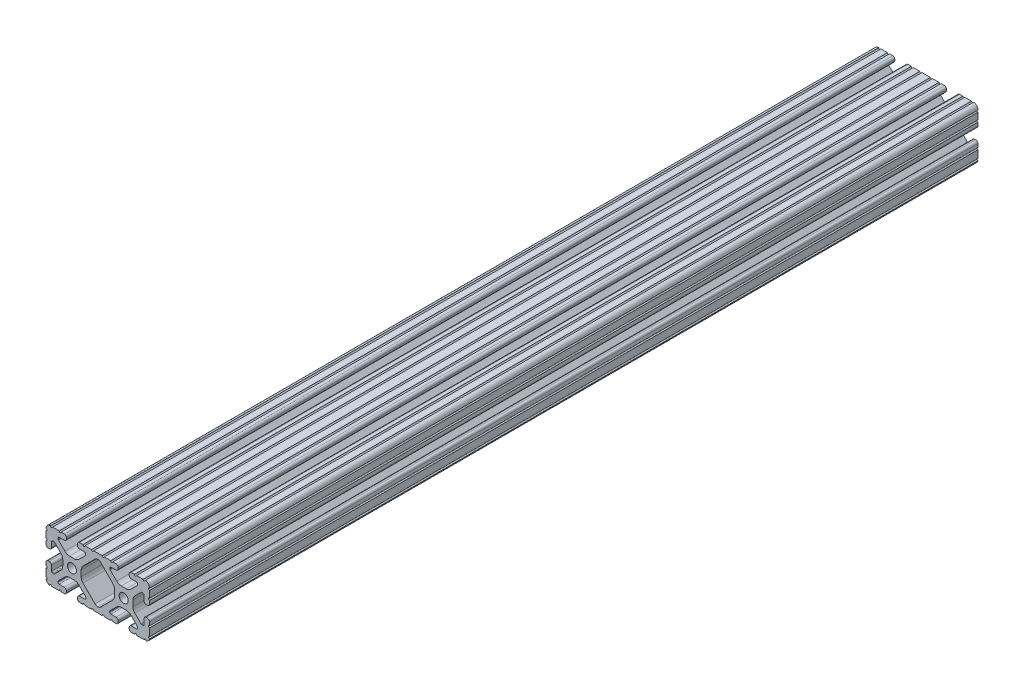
from build123d import *

# Parameters (mm, degrees)
SKETCH1_R      = 3.3274
EXTRUDE1_DEPTH = 609.6
SKETCH2_R      = 3.571875
EXTRUDE2_DEPTH = 38.1
SKETCH3_R      = 3.571875
EXTRUDE3_DEPTH = 76.2


with BuildPart() as part:
    # Sketch1 → Extrude1 (new body)
    with BuildSketch(Plane.XY):
        with BuildLine():
            Line((37.1900335, 54.320138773), (37.1900335, 54.882716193))
            ThreePointArc((37.1900335, 54.882716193), (37.450415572, 55.511334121), (38.0790335, 55.771716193))
            Line((38.0790335, 55.771716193), (41.685477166, 55.771716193))
            ThreePointArc((41.685477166, 55.771716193), (42.799028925, 56.232964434), (43.260277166, 57.346516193))
            Line((43.260277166, 57.346516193), (43.260277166, 58.282488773))
            ThreePointArc((43.260277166, 58.282488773), (42.805347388, 59.380786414), (41.707049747, 59.835716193))
            Line((41.707049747, 59.835716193), (39.271813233, 59.835716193))
            ThreePointArc((39.271813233, 59.835716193), (38.509813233, 59.073716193), (37.747813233, 59.835716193))
            Line((37.747813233, 59.835716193), (32.919398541, 59.835716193))
            ThreePointArc((32.919398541, 59.835716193), (32.157398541, 59.073716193), (31.395398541, 59.835716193))
            Line((31.395398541, 59.835716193), (25.153155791, 59.835716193))
            ThreePointArc((25.153155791, 59.835716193), (24.391155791, 59.073716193), (23.629155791, 59.835716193))
            Line((23.629155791, 59.835716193), (18.800741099, 59.835716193))
            ThreePointArc((18.800741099, 59.835716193), (18.038741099, 59.073716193), (17.276741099, 59.835716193))
            Line((17.276741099, 59.835716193), (14.841504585, 59.835716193))
            ThreePointArc((14.841504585, 59.835716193), (13.743206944, 59.380786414), (13.288277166, 58.282488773))
            Line((13.288277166, 58.282488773), (13.288277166, 57.346516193))
            ThreePointArc((13.288277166, 57.346516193), (13.749525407, 56.232964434), (14.863077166, 55.771716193))
            Line((14.863077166, 55.771716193), (18.469520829, 55.771716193))
            ThreePointArc((18.469520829, 55.771716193), (19.098138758, 55.511334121), (19.358520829, 54.882716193))
            Line((19.358520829, 54.882716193), (19.358520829, 54.320138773))
            ThreePointArc((19.358520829, 54.320138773), (19.290850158, 53.979934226), (19.098140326, 53.691522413))
            Line((19.098140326, 53.691522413), (14.421778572, 49.015137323))
            ThreePointArc((14.421778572, 49.015137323), (12.880829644, 47.985503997), (11.063154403, 47.623944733))
            Line((11.063154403, 47.623944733), (7.38539993, 47.623944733))
            ThreePointArc((7.38539993, 47.623944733), (5.567724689, 47.985503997), (4.026775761, 49.015137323))
            Line((4.026775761, 49.015137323), (-0.649585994, 53.691522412))
            ThreePointArc((-0.649585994, 53.691522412), (-0.842295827, 53.979934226), (-0.909966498, 54.320138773))
            Line((-0.909966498, 54.320138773), (-0.909966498, 54.882716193))
            ThreePointArc((-0.909966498, 54.882716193), (-0.649584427, 55.511334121), (-0.020966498, 55.771716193))
            Line((-0.020966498, 55.771716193), (3.585477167, 55.771716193))
            ThreePointArc((3.585477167, 55.771716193), (4.699028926, 56.232964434), (5.160277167, 57.346516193))
            Line((5.160277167, 57.346516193), (5.160277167, 58.266281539))
            ThreePointArc((5.160277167, 58.266281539), (4.744040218, 59.332924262), (3.715361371, 59.835716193))
            Line((3.715361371, 59.835716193), (1.328459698, 59.835716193))
            ThreePointArc((1.328459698, 59.835716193), (0.566459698, 59.073716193), (-0.195540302, 59.835716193))
            Line((-0.195540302, 59.835716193), (-5.021979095, 59.835716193))
            ThreePointArc((-5.021979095, 59.835716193), (-5.807035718, 59.097492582), (-6.545259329, 59.882549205))
            ThreePointArc((-6.545259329, 59.882549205), (-8.87374186, 58.977730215), (-9.863337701, 56.683993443))
            ThreePointArc((-9.863337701, 56.683993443), (-9.063955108, 55.941735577), (-9.825722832, 55.160922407))
            Line((-9.825722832, 55.160922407), (-9.825722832, 50.335417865))
            ThreePointArc((-9.825722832, 50.335417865), (-9.063722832, 49.573417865), (-9.825722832, 48.811417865))
            Line((-9.825722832, 48.811417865), (-9.825722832, 46.424516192))
            ThreePointArc((-9.825722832, 46.424516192), (-9.364474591, 45.310964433), (-8.250922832, 44.849716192))
            Line((-8.250922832, 44.849716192), (-7.336522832, 44.849716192))
            ThreePointArc((-7.336522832, 44.849716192), (-6.222971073, 45.310964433), (-5.761722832, 46.424516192))
            Line((-5.761722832, 46.424516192), (-5.761722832, 50.183716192))
            ThreePointArc((-5.761722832, 50.183716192), (-5.50134076, 50.81233412), (-4.872722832, 51.072716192))
            Line((-4.872722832, 51.072716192), (-4.146379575, 51.072716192))
            ThreePointArc((-4.146379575, 51.072716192), (-3.806172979, 51.005044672), (-3.517760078, 50.812332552))
            Line((-3.517760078, 50.812332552), (1.076701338, 46.217848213))
            ThreePointArc((1.076701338, 46.217848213), (2.10632244, 44.676905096), (2.467877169, 42.859240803))
            Line((2.467877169, 42.859240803), (2.467877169, 38.712191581))
            ThreePointArc((2.467877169, 38.712191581), (2.10632244, 36.894527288), (1.076701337, 35.353584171))
            Line((1.076701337, 35.353584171), (-3.517760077, 30.759099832))
            ThreePointArc((-3.517760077, 30.759099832), (-3.806172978, 30.566387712), (-4.146379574, 30.498716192))
            Line((-4.146379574, 30.498716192), (-4.872722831, 30.498716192))
            ThreePointArc((-4.872722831, 30.498716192), (-5.501340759, 30.759098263), (-5.761722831, 31.387716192))
            Line((-5.761722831, 31.387716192), (-5.761722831, 35.146916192))
            ThreePointArc((-5.761722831, 35.146916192), (-6.222971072, 36.260467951), (-7.336522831, 36.721716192))
            Line((-7.336522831, 36.721716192), (-8.250922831, 36.721716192))
            ThreePointArc((-8.250922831, 36.721716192), (-9.36447459, 36.260467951), (-9.825722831, 35.146916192))
            Line((-9.825722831, 35.146916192), (-9.825722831, 32.760014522))
            ThreePointArc((-9.825722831, 32.760014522), (-9.063722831, 31.998014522), (-9.825722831, 31.236014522))
            Line((-9.825722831, 31.236014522), (-9.825722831, 25.74969698))
            ThreePointArc((-9.825722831, 25.74969698), (-9.063722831, 24.98769698), (-9.825722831, 24.22569698))
            ThreePointArc((-9.825722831, 24.22569698), (-8.934545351, 22.601713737), (-7.296996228, 21.735716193))
            ThreePointArc((-7.296996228, 21.735716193), (-6.534996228, 22.497716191), (-5.77299623, 21.735716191))
            Line((-5.77299623, 21.735716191), (-0.195540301, 21.735716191))
            ThreePointArc((-0.195540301, 21.735716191), (0.566459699, 22.497716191), (1.328459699, 21.735716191))
            Line((1.328459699, 21.735716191), (3.585477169, 21.735716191))
            ThreePointArc((3.585477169, 21.735716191), (4.699028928, 22.196964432), (5.160277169, 23.310516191))
            Line((5.160277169, 23.310516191), (5.160277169, 24.224916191))
            ThreePointArc((5.160277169, 24.224916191), (4.699028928, 25.33846795), (3.585477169, 25.799716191))
            Line((3.585477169, 25.799716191), (-0.173722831, 25.799716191))
            ThreePointArc((-0.173722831, 25.799716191), (-0.80234076, 26.060098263), (-1.062722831, 26.688716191))
            Line((-1.062722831, 26.688716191), (-1.062722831, 27.098536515))
            ThreePointArc((-1.062722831, 27.098536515), (-0.99505216, 27.438741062), (-0.802342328, 27.727152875))
            Line((-0.802342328, 27.727152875), (4.026775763, 32.556295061))
            ThreePointArc((4.026775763, 32.556295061), (5.567724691, 33.585928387), (7.385399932, 33.947487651))
            Line((7.385399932, 33.947487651), (11.063154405, 33.947487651))
            ThreePointArc((11.063154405, 33.947487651), (12.880829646, 33.585928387), (14.421778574, 32.556295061))
            Line((14.421778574, 32.556295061), (19.250896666, 27.727152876))
            ThreePointArc((19.250896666, 27.727152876), (19.443606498, 27.438741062), (19.511277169, 27.098536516))
            Line((19.511277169, 27.098536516), (19.511277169, 26.688716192))
            ThreePointArc((19.511277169, 26.688716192), (19.250895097, 26.060098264), (18.622277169, 25.799716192))
            Line((18.622277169, 25.799716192), (14.863077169, 25.799716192))
            ThreePointArc((14.863077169, 25.799716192), (13.74952541, 25.338467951), (13.288277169, 24.224916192))
            Line((13.288277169, 24.224916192), (13.288277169, 23.310516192))
            ThreePointArc((13.288277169, 23.310516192), (13.74952541, 22.196964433), (14.863077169, 21.735716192))
            Line((14.863077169, 21.735716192), (17.276741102, 21.735716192))
            ThreePointArc((17.276741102, 21.735716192), (18.038741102, 22.497716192), (18.800741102, 21.735716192))
            Line((18.800741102, 21.735716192), (23.629155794, 21.735716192))
            ThreePointArc((23.629155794, 21.735716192), (24.391155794, 22.497716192), (25.153155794, 21.735716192))
            Line((25.153155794, 21.735716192), (31.395398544, 21.735716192))
            ThreePointArc((31.395398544, 21.735716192), (32.157398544, 22.497716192), (32.919398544, 21.735716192))
            Line((32.919398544, 21.735716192), (37.747813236, 21.735716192))
            ThreePointArc((37.747813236, 21.735716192), (38.509813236, 22.497716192), (39.271813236, 21.735716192))
            Line((39.271813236, 21.735716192), (41.685477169, 21.735716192))
            ThreePointArc((41.685477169, 21.735716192), (42.799028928, 22.196964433), (43.260277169, 23.310516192))
            Line((43.260277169, 23.310516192), (43.260277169, 24.224916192))
            ThreePointArc((43.260277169, 24.224916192), (42.799028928, 25.338467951), (41.685477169, 25.799716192))
            Line((41.685477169, 25.799716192), (37.926277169, 25.799716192))
            ThreePointArc((37.926277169, 25.799716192), (37.29765924, 26.060098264), (37.037277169, 26.688716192))
            Line((37.037277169, 26.688716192), (37.037277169, 27.098536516))
            ThreePointArc((37.037277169, 27.098536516), (37.10494784, 27.438741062), (37.297657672, 27.727152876))
            Line((37.297657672, 27.727152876), (42.126775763, 32.556295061))
            ThreePointArc((42.126775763, 32.556295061), (43.667724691, 33.585928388), (45.485399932, 33.947487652))
            Line((45.485399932, 33.947487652), (49.163154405, 33.947487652))
            ThreePointArc((49.163154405, 33.947487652), (50.980829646, 33.585928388), (52.521778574, 32.556295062))
            Line((52.521778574, 32.556295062), (57.350896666, 27.727152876))
            ThreePointArc((57.350896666, 27.727152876), (57.543606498, 27.438741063), (57.611277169, 27.098536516))
            Line((57.611277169, 27.098536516), (57.611277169, 26.688716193))
            ThreePointArc((57.611277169, 26.688716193), (57.350895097, 26.060098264), (56.722277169, 25.799716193))
            Line((56.722277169, 25.799716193), (52.963077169, 25.799716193))
            ThreePointArc((52.963077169, 25.799716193), (51.84952541, 25.338467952), (51.388277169, 24.224916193))
            Line((51.388277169, 24.224916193), (51.388277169, 23.310516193))
            ThreePointArc((51.388277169, 23.310516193), (51.84952541, 22.196964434), (52.963077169, 21.735716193))
            Line((52.963077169, 21.735716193), (55.220094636, 21.735716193))
            ThreePointArc((55.220094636, 21.735716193), (55.982094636, 22.497716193), (56.744094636, 21.735716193))
            Line((56.744094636, 21.735716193), (62.321550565, 21.735716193))
            ThreePointArc((62.321550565, 21.735716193), (63.083550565, 22.497716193), (63.845550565, 21.735716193))
            ThreePointArc((63.845550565, 21.735716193), (65.481854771, 22.602978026), (66.374277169, 24.225696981))
            ThreePointArc((66.374277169, 24.225696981), (65.612277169, 24.987696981), (66.374277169, 25.749696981))
            Line((66.374277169, 25.749696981), (66.374277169, 31.236014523))
            ThreePointArc((66.374277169, 31.236014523), (65.612277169, 31.998014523), (66.374277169, 32.760014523))
            Line((66.374277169, 32.760014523), (66.374277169, 35.146916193))
            ThreePointArc((66.374277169, 35.146916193), (65.913028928, 36.260467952), (64.799477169, 36.721716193))
            Line((64.799477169, 36.721716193), (63.885077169, 36.721716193))
            ThreePointArc((63.885077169, 36.721716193), (62.77152541, 36.260467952), (62.310277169, 35.146916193))
            Line((62.310277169, 35.146916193), (62.310277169, 31.387716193))
            ThreePointArc((62.310277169, 31.387716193), (62.049895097, 30.759098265), (61.421277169, 30.498716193))
            Line((61.421277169, 30.498716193), (60.694933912, 30.498716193))
            ThreePointArc((60.694933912, 30.498716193), (60.354727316, 30.566387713), (60.066314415, 30.759099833))
            Line((60.066314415, 30.759099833), (55.471853, 35.353584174))
            ThreePointArc((55.471853, 35.353584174), (54.442231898, 36.894527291), (54.08067717, 38.712191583))
            Line((54.08067717, 38.712191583), (54.08067717, 42.859240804))
            ThreePointArc((54.08067717, 42.859240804), (54.442231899, 44.676905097), (55.471853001, 46.217848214))
            Line((55.471853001, 46.217848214), (60.066314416, 50.812332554))
            ThreePointArc((60.066314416, 50.812332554), (60.354727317, 51.005044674), (60.694933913, 51.072716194))
            Line((60.694933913, 51.072716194), (61.42127717, 51.072716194))
            ThreePointArc((61.42127717, 51.072716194), (62.049895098, 50.812334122), (62.31027717, 50.183716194))
            Line((62.31027717, 50.183716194), (62.31027717, 46.424516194))
            ThreePointArc((62.31027717, 46.424516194), (62.771525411, 45.310964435), (63.88507717, 44.849716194))
            Line((63.88507717, 44.849716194), (64.79947717, 44.849716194))
            ThreePointArc((64.79947717, 44.849716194), (65.913028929, 45.310964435), (66.37427717, 46.424516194))
            Line((66.37427717, 46.424516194), (66.37427717, 48.811417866))
            ThreePointArc((66.37427717, 48.811417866), (65.61227717, 49.573417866), (66.37427717, 50.335417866))
            Line((66.37427717, 50.335417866), (66.37427717, 55.160922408))
            ThreePointArc((66.37427717, 55.160922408), (65.612509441, 55.941735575), (66.411892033, 56.683993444))
            ThreePointArc((66.411892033, 56.683993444), (65.422296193, 58.977730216), (63.093813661, 59.882549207))
            ThreePointArc((63.093813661, 59.882549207), (62.355590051, 59.097492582), (61.570533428, 59.835716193))
            Line((61.570533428, 59.835716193), (56.744094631, 59.835716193))
            ThreePointArc((56.744094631, 59.835716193), (55.982094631, 59.073716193), (55.220094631, 59.835716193))
            Line((55.220094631, 59.835716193), (52.833192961, 59.835716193))
            ThreePointArc((52.833192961, 59.835716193), (51.804514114, 59.332924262), (51.388277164, 58.266281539))
            Line((51.388277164, 58.266281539), (51.388277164, 57.346516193))
            ThreePointArc((51.388277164, 57.346516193), (51.849525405, 56.232964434), (52.963077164, 55.771716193))
            Line((52.963077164, 55.771716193), (56.569520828, 55.771716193))
            ThreePointArc((56.569520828, 55.771716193), (57.198138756, 55.511334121), (57.458520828, 54.882716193))
            Line((57.458520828, 54.882716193), (57.458520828, 54.320138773))
            ThreePointArc((57.458520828, 54.320138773), (57.390850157, 53.979934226), (57.198140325, 53.691522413))
            Line((57.198140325, 53.691522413), (52.52177857, 49.015137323))
            ThreePointArc((52.52177857, 49.015137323), (50.980829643, 47.985503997), (49.163154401, 47.623944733))
            Line((49.163154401, 47.623944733), (45.485399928, 47.623944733))
            ThreePointArc((45.485399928, 47.623944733), (43.667724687, 47.985503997), (42.12677576, 49.015137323))
            Line((42.12677576, 49.015137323), (37.450414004, 53.691522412))
            ThreePointArc((37.450414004, 53.691522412), (37.257704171, 53.979934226), (37.1900335, 54.320138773))
        make_face()
        with Locations(Location((47.324277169, 40.785716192, 0), (0, 0, 180))):
            Circle(SKETCH1_R, mode=Mode.SUBTRACT)
        with Locations(Location((9.224277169, 40.785716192, 0), (0, 0, 180))):
            Circle(SKETCH1_R, mode=Mode.SUBTRACT)
        with BuildLine():
            Line((30.35131253, 26.52815133), (39.176701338, 35.353584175))
            ThreePointArc((39.176701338, 35.353584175), (40.206322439, 36.894527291), (40.567877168, 38.712191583))
            Line((40.567877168, 38.712191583), (40.567877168, 42.859240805))
            ThreePointArc((40.567877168, 42.859240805), (40.206322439, 44.676905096), (39.176701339, 46.217848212))
            Line((39.176701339, 46.217848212), (30.35131253, 55.043281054))
            ThreePointArc((30.35131253, 55.043281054), (29.39832277, 55.678689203), (28.274277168, 55.898812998))
            ThreePointArc((28.274277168, 55.898812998), (27.150231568, 55.678689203), (26.197241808, 55.043281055))
            Line((26.197241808, 55.043281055), (17.371853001, 46.217848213))
            ThreePointArc((17.371853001, 46.217848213), (16.342231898, 44.676905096), (15.980677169, 42.859240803))
            Line((15.980677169, 42.859240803), (15.980677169, 38.712191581))
            ThreePointArc((15.980677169, 38.712191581), (16.342231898, 36.894527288), (17.371853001, 35.353584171))
            Line((17.371853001, 35.353584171), (26.197241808, 26.528151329))
            ThreePointArc((26.197241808, 26.528151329), (27.150231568, 25.892743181), (28.274277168, 25.672619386))
            ThreePointArc((28.274277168, 25.672619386), (29.39832277, 25.892743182), (30.35131253, 26.52815133))
        make_face(mode=Mode.SUBTRACT)
    extrude(amount=EXTRUDE1_DEPTH)

    # Sketch2 → Extrude2 (cut)
    with BuildSketch(Plane.XZ.offset(-21.735716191)):
        with Locations(Location((9.224277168, 323.85, 0), (0, 0, 239.014490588))):
            Circle(SKETCH2_R)
        with Locations(Location((9.224277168, 285.75, 0), (0, 0, 239.014490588))):
            Circle(SKETCH2_R)
    extrude(amount=-EXTRUDE2_DEPTH, mode=Mode.SUBTRACT)

    # Sketch3 → Extrude3 (cut)
    with BuildSketch(Plane(origin=(66.37427717, 0, 0), x_dir=(0, 0, -1), z_dir=(1, 0, 0))):
        with Locations(Location((-19.05, 40.833625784, 0), (0, 0, 145.451661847))):
            Circle(SKETCH3_R)
        with Locations(Location((-57.15, 40.833625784, 0), (0, 0, 145.451661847))):
            Circle(SKETCH3_R)
        with Locations(Location((-590.55, 40.833625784, 0), (0, 0, 145.451661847))):
            Circle(SKETCH3_R)
        with Locations(Location((-552.45, 40.785716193, 0), (0, 0, 35.486725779))):
            Circle(SKETCH3_R)
    extrude(amount=-EXTRUDE3_DEPTH, mode=Mode.SUBTRACT)


solid = part.part
